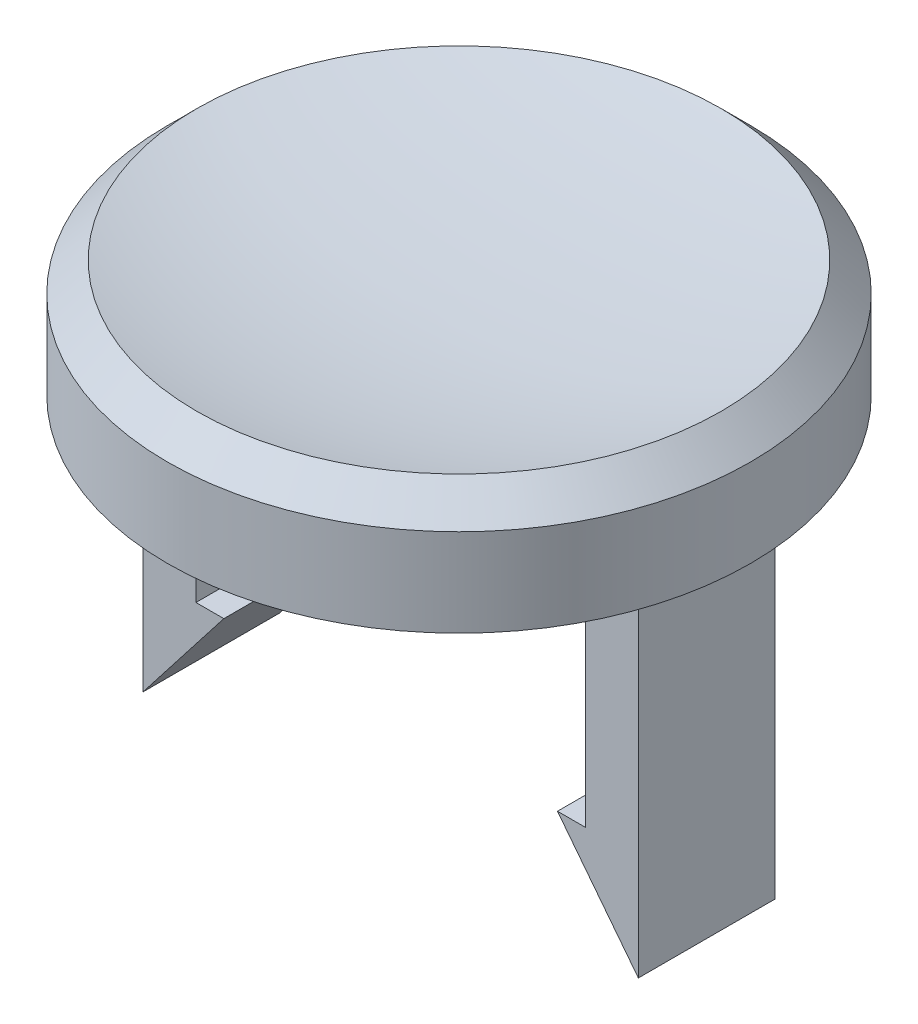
ISO-10303-21;
HEADER;
FILE_DESCRIPTION(('STEP AP214'),'2;1');
FILE_NAME('part.step','',(''),(''),'','','');
FILE_SCHEMA(('AUTOMOTIVE_DESIGN { 1 0 10303 214 1 1 1 1 }'));
ENDSEC;
DATA;
#1=APPLICATION_CONTEXT('core data for automotive mechanical design processes');
#2=APPLICATION_PROTOCOL_DEFINITION('international standard','automotive_design',2000,#1);
#3=PRODUCT_CONTEXT('',#1,'mechanical');
#4=PRODUCT('Part','Part','',(#3));
#5=PRODUCT_RELATED_PRODUCT_CATEGORY('part','',(#4));
#6=PRODUCT_DEFINITION_FORMATION('','',#4);
#7=PRODUCT_DEFINITION_CONTEXT('part definition',#1,'design');
#8=PRODUCT_DEFINITION('design','',#6,#7);
#9=PRODUCT_DEFINITION_SHAPE('','',#8);
#10=(LENGTH_UNIT() NAMED_UNIT(*) SI_UNIT(.MILLI.,.METRE.));
#11=(NAMED_UNIT(*) PLANE_ANGLE_UNIT() SI_UNIT($,.RADIAN.));
#12=(NAMED_UNIT(*) SI_UNIT($,.STERADIAN.) SOLID_ANGLE_UNIT());
#13=UNCERTAINTY_MEASURE_WITH_UNIT(LENGTH_MEASURE(1.E-05),#10,'distance_accuracy_value','');
#14=(GEOMETRIC_REPRESENTATION_CONTEXT(3) GLOBAL_UNCERTAINTY_ASSIGNED_CONTEXT((#13)) GLOBAL_UNIT_ASSIGNED_CONTEXT((#10,
#11,#12)) REPRESENTATION_CONTEXT('',''));
#15=CARTESIAN_POINT('',(0.,0.,0.));
#16=DIRECTION('',(0.,0.,1.));
#17=DIRECTION('',(1.,0.,0.));
#18=AXIS2_PLACEMENT_3D('',#15,#16,#17);
#19=CARTESIAN_POINT('',(0.,0.,0.));
#20=DIRECTION('',(0.,1.,0.));
#21=DIRECTION('',(0.,0.,1.));
#22=AXIS2_PLACEMENT_3D('',#19,#20,#21);
#23=PLANE('',#22);
#24=DIRECTION('',(-1.,0.,0.));
#25=VECTOR('',#24,1.);
#26=CARTESIAN_POINT('',(8.88,0.,-2.45));
#27=LINE('',#26,#25);
#28=CARTESIAN_POINT('',(8.88,0.,-2.45));
#29=VERTEX_POINT('',#28);
#30=CARTESIAN_POINT('',(6.98,0.,-2.45));
#31=VERTEX_POINT('',#30);
#32=EDGE_CURVE('E159',#29,#31,#27,.T.);
#33=ORIENTED_EDGE('',*,*,#32,.T.);
#34=DIRECTION('',(0.,0.,1.));
#35=VECTOR('',#34,1.);
#36=CARTESIAN_POINT('',(6.98,0.,-2.45));
#37=LINE('',#36,#35);
#38=CARTESIAN_POINT('',(6.98,0.,2.45));
#39=VERTEX_POINT('',#38);
#40=EDGE_CURVE('E155',#31,#39,#37,.T.);
#41=ORIENTED_EDGE('',*,*,#40,.T.);
#42=DIRECTION('',(1.,0.,0.));
#43=VECTOR('',#42,1.);
#44=CARTESIAN_POINT('',(8.88,0.,2.45));
#45=LINE('',#44,#43);
#46=CARTESIAN_POINT('',(8.88,0.,2.45));
#47=VERTEX_POINT('',#46);
#48=EDGE_CURVE('E167',#39,#47,#45,.T.);
#49=ORIENTED_EDGE('',*,*,#48,.T.);
#50=DIRECTION('',(0.,0.,-1.));
#51=VECTOR('',#50,1.);
#52=CARTESIAN_POINT('',(8.88,0.,-2.45));
#53=LINE('',#52,#51);
#54=EDGE_CURVE('E54',#47,#29,#53,.T.);
#55=ORIENTED_EDGE('',*,*,#54,.T.);
#56=EDGE_LOOP('',(#33,#41,#49,#55));
#57=FACE_BOUND('',#56,.T.);
#58=CARTESIAN_POINT('',(0.,0.,0.));
#59=DIRECTION('',(0.,1.,0.));
#60=DIRECTION('',(0.,0.,1.));
#61=AXIS2_PLACEMENT_3D('',#58,#59,#60);
#62=CIRCLE('',#61,10.45);
#63=CARTESIAN_POINT('',(0.,0.,10.45));
#64=VERTEX_POINT('',#63);
#65=EDGE_CURVE('E46',#64,#64,#62,.T.);
#66=ORIENTED_EDGE('',*,*,#65,.F.);
#67=EDGE_LOOP('',(#66));
#68=FACE_BOUND('',#67,.T.);
#69=DIRECTION('',(0.,0.,1.));
#70=VECTOR('',#69,1.);
#71=CARTESIAN_POINT('',(-6.98,0.,-2.45));
#72=LINE('',#71,#70);
#73=CARTESIAN_POINT('',(-6.98,0.,-2.45));
#74=VERTEX_POINT('',#73);
#75=CARTESIAN_POINT('',(-6.98,0.,2.45));
#76=VERTEX_POINT('',#75);
#77=EDGE_CURVE('E264',#74,#76,#72,.T.);
#78=ORIENTED_EDGE('',*,*,#77,.F.);
#79=DIRECTION('',(1.,0.,0.));
#80=VECTOR('',#79,1.);
#81=CARTESIAN_POINT('',(-8.88,0.,-2.45));
#82=LINE('',#81,#80);
#83=CARTESIAN_POINT('',(-8.88,0.,-2.45));
#84=VERTEX_POINT('',#83);
#85=EDGE_CURVE('E224',#84,#74,#82,.T.);
#86=ORIENTED_EDGE('',*,*,#85,.F.);
#87=DIRECTION('',(0.,0.,-1.));
#88=VECTOR('',#87,1.);
#89=CARTESIAN_POINT('',(-8.88,0.,-2.45));
#90=LINE('',#89,#88);
#91=CARTESIAN_POINT('',(-8.88,0.,2.45));
#92=VERTEX_POINT('',#91);
#93=EDGE_CURVE('E268',#92,#84,#90,.T.);
#94=ORIENTED_EDGE('',*,*,#93,.F.);
#95=DIRECTION('',(-1.,0.,0.));
#96=VECTOR('',#95,1.);
#97=CARTESIAN_POINT('',(-8.88,0.,2.45));
#98=LINE('',#97,#96);
#99=EDGE_CURVE('E62',#76,#92,#98,.T.);
#100=ORIENTED_EDGE('',*,*,#99,.F.);
#101=EDGE_LOOP('',(#78,#86,#94,#100));
#102=FACE_BOUND('',#101,.T.);
#103=ADVANCED_FACE('F37',(#57,#68,#102),#23,.F.);
#104=CARTESIAN_POINT('',(0.,4.2,0.));
#105=DIRECTION('',(0.,-1.,0.));
#106=DIRECTION('',(0.,0.,-1.));
#107=AXIS2_PLACEMENT_3D('',#104,#105,#106);
#108=CYLINDRICAL_SURFACE('',#107,10.45);
#109=CARTESIAN_POINT('',(0.,3.15,0.));
#110=DIRECTION('',(0.,1.,0.));
#111=DIRECTION('',(0.,0.,1.));
#112=AXIS2_PLACEMENT_3D('',#109,#110,#111);
#113=CIRCLE('',#112,10.45);
#114=CARTESIAN_POINT('',(0.,3.15,10.45));
#115=VERTEX_POINT('',#114);
#116=EDGE_CURVE('E11',#115,#115,#113,.F.);
#117=ORIENTED_EDGE('',*,*,#116,.T.);
#118=EDGE_LOOP('',(#117));
#119=FACE_BOUND('',#118,.T.);
#120=ORIENTED_EDGE('',*,*,#65,.T.);
#121=EDGE_LOOP('',(#120));
#122=FACE_BOUND('',#121,.T.);
#123=ADVANCED_FACE('F252',(#119,#122),#108,.T.);
#124=CARTESIAN_POINT('',(0.,4.2,0.));
#125=DIRECTION('',(0.,-1.,0.));
#126=DIRECTION('',(0.,0.,-1.));
#127=AXIS2_PLACEMENT_3D('',#124,#125,#126);
#128=CONICAL_SURFACE('',#127,9.4,0.785398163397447);
#129=ORIENTED_EDGE('',*,*,#116,.F.);
#130=EDGE_LOOP('',(#129));
#131=FACE_BOUND('',#130,.T.);
#132=CARTESIAN_POINT('',(0.,4.2,0.));
#133=DIRECTION('',(0.,-1.,0.));
#134=DIRECTION('',(0.,0.,-1.));
#135=AXIS2_PLACEMENT_3D('',#132,#133,#134);
#136=CIRCLE('',#135,9.4);
#137=CARTESIAN_POINT('',(0.,4.2,-9.4));
#138=VERTEX_POINT('',#137);
#139=EDGE_CURVE('E228',#138,#138,#136,.T.);
#140=ORIENTED_EDGE('',*,*,#139,.T.);
#141=EDGE_LOOP('',(#140));
#142=FACE_BOUND('',#141,.T.);
#143=ADVANCED_FACE('F39',(#131,#142),#128,.T.);
#144=CARTESIAN_POINT('',(0.,4.2,9.4));
#145=CARTESIAN_POINT('',(0.,3.17283314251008,5.48375547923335));
#146=CARTESIAN_POINT('',(0.,3.15,0.));
#147=B_SPLINE_CURVE_WITH_KNOTS('',2,(#144,#145,#146),.UNSPECIFIED.,.F.,.F.,(3,3),(0.,1.),.UNSPECIFIED.);
#148=CARTESIAN_POINT('',(0.,3.15,0.));
#149=DIRECTION('',(0.,-1.,0.));
#150=AXIS1_PLACEMENT('',#148,#149);
#151=SURFACE_OF_REVOLUTION('',#147,#150);
#152=CARTESIAN_POINT('',(0.,3.15,0.));
#153=VERTEX_POINT('',#152);
#154=VERTEX_LOOP('',#153);
#155=FACE_BOUND('',#154,.T.);
#156=ORIENTED_EDGE('',*,*,#139,.F.);
#157=EDGE_LOOP('',(#156));
#158=FACE_BOUND('',#157,.T.);
#159=ADVANCED_FACE('F244',(#155,#158),#151,.F.);
#160=CARTESIAN_POINT('',(-6.98,-8.7,-2.45));
#161=DIRECTION('',(-1.,0.,0.));
#162=DIRECTION('',(0.,0.,1.));
#163=AXIS2_PLACEMENT_3D('',#160,#161,#162);
#164=PLANE('',#163);
#165=ORIENTED_EDGE('',*,*,#77,.T.);
#166=DIRECTION('',(0.,1.,0.));
#167=VECTOR('',#166,1.);
#168=CARTESIAN_POINT('',(-6.98,-8.7,2.45));
#169=LINE('',#168,#167);
#170=CARTESIAN_POINT('',(-6.98,-8.7,2.45));
#171=VERTEX_POINT('',#170);
#172=EDGE_CURVE('E227',#171,#76,#169,.T.);
#173=ORIENTED_EDGE('',*,*,#172,.F.);
#174=DIRECTION('',(0.,0.,1.));
#175=VECTOR('',#174,1.);
#176=CARTESIAN_POINT('',(-6.98,-8.7,-2.45));
#177=LINE('',#176,#175);
#178=CARTESIAN_POINT('',(-6.98,-8.7,-2.45));
#179=VERTEX_POINT('',#178);
#180=EDGE_CURVE('E221',#179,#171,#177,.T.);
#181=ORIENTED_EDGE('',*,*,#180,.F.);
#182=DIRECTION('',(0.,1.,0.));
#183=VECTOR('',#182,1.);
#184=CARTESIAN_POINT('',(-6.98,-8.7,-2.45));
#185=LINE('',#184,#183);
#186=EDGE_CURVE('E218',#179,#74,#185,.T.);
#187=ORIENTED_EDGE('',*,*,#186,.T.);
#188=EDGE_LOOP('',(#165,#173,#181,#187));
#189=FACE_BOUND('',#188,.T.);
#190=ADVANCED_FACE('F248',(#189),#164,.F.);
#191=CARTESIAN_POINT('',(-8.88,-8.7,2.45));
#192=DIRECTION('',(0.,0.,-1.));
#193=DIRECTION('',(-1.,0.,0.));
#194=AXIS2_PLACEMENT_3D('',#191,#192,#193);
#195=PLANE('',#194);
#196=ORIENTED_EDGE('',*,*,#99,.T.);
#197=DIRECTION('',(0.,1.,0.));
#198=VECTOR('',#197,1.);
#199=CARTESIAN_POINT('',(-8.88,-8.7,2.45));
#200=LINE('',#199,#198);
#201=CARTESIAN_POINT('',(-8.88,-12.4276104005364,2.45));
#202=VERTEX_POINT('',#201);
#203=EDGE_CURVE('E229',#202,#92,#200,.T.);
#204=ORIENTED_EDGE('',*,*,#203,.F.);
#205=DIRECTION('',(0.614039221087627,0.789275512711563,0.));
#206=VECTOR('',#205,1.);
#207=CARTESIAN_POINT('',(0.491145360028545,-0.382100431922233,2.45));
#208=LINE('',#207,#206);
#209=CARTESIAN_POINT('',(-5.98,-8.7,2.45));
#210=VERTEX_POINT('',#209);
#211=EDGE_CURVE('E176',#202,#210,#208,.T.);
#212=ORIENTED_EDGE('',*,*,#211,.T.);
#213=DIRECTION('',(1.,0.,0.));
#214=VECTOR('',#213,1.);
#215=CARTESIAN_POINT('',(0.,-8.7,2.45));
#216=LINE('',#215,#214);
#217=EDGE_CURVE('E179',#171,#210,#216,.T.);
#218=ORIENTED_EDGE('',*,*,#217,.F.);
#219=ORIENTED_EDGE('',*,*,#172,.T.);
#220=EDGE_LOOP('',(#196,#204,#212,#218,#219));
#221=FACE_BOUND('',#220,.T.);
#222=ADVANCED_FACE('F286',(#221),#195,.F.);
#223=CARTESIAN_POINT('',(-8.88,-8.7,-2.45));
#224=DIRECTION('',(1.,0.,0.));
#225=DIRECTION('',(0.,0.,-1.));
#226=AXIS2_PLACEMENT_3D('',#223,#224,#225);
#227=PLANE('',#226);
#228=ORIENTED_EDGE('',*,*,#93,.T.);
#229=DIRECTION('',(0.,1.,0.));
#230=VECTOR('',#229,1.);
#231=CARTESIAN_POINT('',(-8.88,-8.7,-2.45));
#232=LINE('',#231,#230);
#233=CARTESIAN_POINT('',(-8.88,-12.4276104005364,-2.45));
#234=VERTEX_POINT('',#233);
#235=EDGE_CURVE('E210',#234,#84,#232,.T.);
#236=ORIENTED_EDGE('',*,*,#235,.F.);
#237=DIRECTION('',(0.,0.,-1.));
#238=VECTOR('',#237,1.);
#239=CARTESIAN_POINT('',(-8.88,-12.4276104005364,7.17282535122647));
#240=LINE('',#239,#238);
#241=EDGE_CURVE('E183',#202,#234,#240,.T.);
#242=ORIENTED_EDGE('',*,*,#241,.F.);
#243=ORIENTED_EDGE('',*,*,#203,.T.);
#244=EDGE_LOOP('',(#228,#236,#242,#243));
#245=FACE_BOUND('',#244,.T.);
#246=ADVANCED_FACE('F280',(#245),#227,.F.);
#247=CARTESIAN_POINT('',(-8.88,-8.7,-2.45));
#248=DIRECTION('',(0.,0.,1.));
#249=DIRECTION('',(1.,0.,0.));
#250=AXIS2_PLACEMENT_3D('',#247,#248,#249);
#251=PLANE('',#250);
#252=ORIENTED_EDGE('',*,*,#85,.T.);
#253=ORIENTED_EDGE('',*,*,#186,.F.);
#254=DIRECTION('',(-1.,0.,0.));
#255=VECTOR('',#254,1.);
#256=CARTESIAN_POINT('',(0.,-8.7,-2.45));
#257=LINE('',#256,#255);
#258=CARTESIAN_POINT('',(-5.98,-8.7,-2.45));
#259=VERTEX_POINT('',#258);
#260=EDGE_CURVE('E185',#259,#179,#257,.T.);
#261=ORIENTED_EDGE('',*,*,#260,.F.);
#262=DIRECTION('',(-0.614039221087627,-0.789275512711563,0.));
#263=VECTOR('',#262,1.);
#264=CARTESIAN_POINT('',(0.491145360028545,-0.382100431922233,-2.45));
#265=LINE('',#264,#263);
#266=EDGE_CURVE('E189',#259,#234,#265,.T.);
#267=ORIENTED_EDGE('',*,*,#266,.T.);
#268=ORIENTED_EDGE('',*,*,#235,.T.);
#269=EDGE_LOOP('',(#252,#253,#261,#267,#268));
#270=FACE_BOUND('',#269,.T.);
#271=ADVANCED_FACE('F209',(#270),#251,.F.);
#272=CARTESIAN_POINT('',(0.,-8.7,7.17282535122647));
#273=DIRECTION('',(0.,-1.,0.));
#274=DIRECTION('',(0.,0.,-1.));
#275=AXIS2_PLACEMENT_3D('',#272,#273,#274);
#276=PLANE('',#275);
#277=ORIENTED_EDGE('',*,*,#260,.T.);
#278=ORIENTED_EDGE('',*,*,#180,.T.);
#279=ORIENTED_EDGE('',*,*,#217,.T.);
#280=DIRECTION('',(0.,0.,-1.));
#281=VECTOR('',#280,1.);
#282=CARTESIAN_POINT('',(-5.98,-8.7,7.17282535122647));
#283=LINE('',#282,#281);
#284=EDGE_CURVE('E182',#210,#259,#283,.T.);
#285=ORIENTED_EDGE('',*,*,#284,.T.);
#286=EDGE_LOOP('',(#277,#278,#279,#285));
#287=FACE_BOUND('',#286,.T.);
#288=ADVANCED_FACE('F271',(#287),#276,.F.);
#289=CARTESIAN_POINT('',(0.491145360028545,-0.382100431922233,7.17282535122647));
#290=DIRECTION('',(0.789275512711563,-0.614039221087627,0.));
#291=DIRECTION('',(0.614039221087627,0.789275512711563,0.));
#292=AXIS2_PLACEMENT_3D('',#289,#290,#291);
#293=PLANE('',#292);
#294=ORIENTED_EDGE('',*,*,#211,.F.);
#295=ORIENTED_EDGE('',*,*,#241,.T.);
#296=ORIENTED_EDGE('',*,*,#266,.F.);
#297=ORIENTED_EDGE('',*,*,#284,.F.);
#298=EDGE_LOOP('',(#294,#295,#296,#297));
#299=FACE_BOUND('',#298,.T.);
#300=ADVANCED_FACE('F202',(#299),#293,.T.);
#301=CARTESIAN_POINT('',(6.98,-8.7,-2.45));
#302=DIRECTION('',(-1.,0.,0.));
#303=DIRECTION('',(0.,0.,1.));
#304=AXIS2_PLACEMENT_3D('',#301,#302,#303);
#305=PLANE('',#304);
#306=ORIENTED_EDGE('',*,*,#40,.F.);
#307=DIRECTION('',(0.,1.,0.));
#308=VECTOR('',#307,1.);
#309=CARTESIAN_POINT('',(6.98,-8.7,-2.45));
#310=LINE('',#309,#308);
#311=CARTESIAN_POINT('',(6.98,-8.7,-2.45));
#312=VERTEX_POINT('',#311);
#313=EDGE_CURVE('E173',#312,#31,#310,.T.);
#314=ORIENTED_EDGE('',*,*,#313,.F.);
#315=DIRECTION('',(0.,0.,1.));
#316=VECTOR('',#315,1.);
#317=CARTESIAN_POINT('',(6.98,-8.7,-2.45));
#318=LINE('',#317,#316);
#319=CARTESIAN_POINT('',(6.98,-8.7,2.45));
#320=VERTEX_POINT('',#319);
#321=EDGE_CURVE('E142',#312,#320,#318,.T.);
#322=ORIENTED_EDGE('',*,*,#321,.T.);
#323=DIRECTION('',(0.,1.,0.));
#324=VECTOR('',#323,1.);
#325=CARTESIAN_POINT('',(6.98,-8.7,2.45));
#326=LINE('',#325,#324);
#327=EDGE_CURVE('E171',#320,#39,#326,.T.);
#328=ORIENTED_EDGE('',*,*,#327,.T.);
#329=EDGE_LOOP('',(#306,#314,#322,#328));
#330=FACE_BOUND('',#329,.T.);
#331=ADVANCED_FACE('F278',(#330),#305,.T.);
#332=CARTESIAN_POINT('',(8.88,-8.7,-2.45));
#333=DIRECTION('',(0.,0.,-1.));
#334=DIRECTION('',(-1.,0.,0.));
#335=AXIS2_PLACEMENT_3D('',#332,#333,#334);
#336=PLANE('',#335);
#337=ORIENTED_EDGE('',*,*,#32,.F.);
#338=DIRECTION('',(0.,1.,0.));
#339=VECTOR('',#338,1.);
#340=CARTESIAN_POINT('',(8.88,-8.7,-2.45));
#341=LINE('',#340,#339);
#342=CARTESIAN_POINT('',(8.88,-12.4276104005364,-2.45));
#343=VERTEX_POINT('',#342);
#344=EDGE_CURVE('E137',#343,#29,#341,.T.);
#345=ORIENTED_EDGE('',*,*,#344,.F.);
#346=DIRECTION('',(0.614039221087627,-0.789275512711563,0.));
#347=VECTOR('',#346,1.);
#348=CARTESIAN_POINT('',(-0.491145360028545,-0.382100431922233,-2.45));
#349=LINE('',#348,#347);
#350=CARTESIAN_POINT('',(5.98,-8.7,-2.45));
#351=VERTEX_POINT('',#350);
#352=EDGE_CURVE('E124',#351,#343,#349,.T.);
#353=ORIENTED_EDGE('',*,*,#352,.F.);
#354=DIRECTION('',(1.,0.,0.));
#355=VECTOR('',#354,1.);
#356=CARTESIAN_POINT('',(0.,-8.7,-2.45));
#357=LINE('',#356,#355);
#358=EDGE_CURVE('E130',#351,#312,#357,.T.);
#359=ORIENTED_EDGE('',*,*,#358,.T.);
#360=ORIENTED_EDGE('',*,*,#313,.T.);
#361=EDGE_LOOP('',(#337,#345,#353,#359,#360));
#362=FACE_BOUND('',#361,.T.);
#363=ADVANCED_FACE('F135',(#362),#336,.T.);
#364=CARTESIAN_POINT('',(8.88,-8.7,-2.45));
#365=DIRECTION('',(1.,0.,0.));
#366=DIRECTION('',(0.,0.,-1.));
#367=AXIS2_PLACEMENT_3D('',#364,#365,#366);
#368=PLANE('',#367);
#369=ORIENTED_EDGE('',*,*,#54,.F.);
#370=DIRECTION('',(0.,1.,0.));
#371=VECTOR('',#370,1.);
#372=CARTESIAN_POINT('',(8.88,-8.7,2.45));
#373=LINE('',#372,#371);
#374=CARTESIAN_POINT('',(8.88,-12.4276104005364,2.45));
#375=VERTEX_POINT('',#374);
#376=EDGE_CURVE('E169',#375,#47,#373,.T.);
#377=ORIENTED_EDGE('',*,*,#376,.F.);
#378=DIRECTION('',(0.,0.,-1.));
#379=VECTOR('',#378,1.);
#380=CARTESIAN_POINT('',(8.88,-12.4276104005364,7.17282535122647));
#381=LINE('',#380,#379);
#382=EDGE_CURVE('E129',#375,#343,#381,.T.);
#383=ORIENTED_EDGE('',*,*,#382,.T.);
#384=ORIENTED_EDGE('',*,*,#344,.T.);
#385=EDGE_LOOP('',(#369,#377,#383,#384));
#386=FACE_BOUND('',#385,.T.);
#387=ADVANCED_FACE('F372',(#386),#368,.T.);
#388=CARTESIAN_POINT('',(8.88,-8.7,2.45));
#389=DIRECTION('',(0.,0.,1.));
#390=DIRECTION('',(1.,0.,0.));
#391=AXIS2_PLACEMENT_3D('',#388,#389,#390);
#392=PLANE('',#391);
#393=ORIENTED_EDGE('',*,*,#48,.F.);
#394=ORIENTED_EDGE('',*,*,#327,.F.);
#395=DIRECTION('',(-1.,0.,0.));
#396=VECTOR('',#395,1.);
#397=CARTESIAN_POINT('',(0.,-8.7,2.45));
#398=LINE('',#397,#396);
#399=CARTESIAN_POINT('',(5.98,-8.7,2.45));
#400=VERTEX_POINT('',#399);
#401=EDGE_CURVE('E147',#320,#400,#398,.T.);
#402=ORIENTED_EDGE('',*,*,#401,.T.);
#403=DIRECTION('',(-0.614039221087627,0.789275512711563,0.));
#404=VECTOR('',#403,1.);
#405=CARTESIAN_POINT('',(-0.491145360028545,-0.382100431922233,2.45));
#406=LINE('',#405,#404);
#407=EDGE_CURVE('E126',#375,#400,#406,.T.);
#408=ORIENTED_EDGE('',*,*,#407,.F.);
#409=ORIENTED_EDGE('',*,*,#376,.T.);
#410=EDGE_LOOP('',(#393,#394,#402,#408,#409));
#411=FACE_BOUND('',#410,.T.);
#412=ADVANCED_FACE('F380',(#411),#392,.T.);
#413=CARTESIAN_POINT('',(0.,-8.7,7.17282535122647));
#414=DIRECTION('',(0.,1.,0.));
#415=DIRECTION('',(0.,0.,1.));
#416=AXIS2_PLACEMENT_3D('',#413,#414,#415);
#417=PLANE('',#416);
#418=ORIENTED_EDGE('',*,*,#321,.F.);
#419=ORIENTED_EDGE('',*,*,#358,.F.);
#420=DIRECTION('',(0.,0.,-1.));
#421=VECTOR('',#420,1.);
#422=CARTESIAN_POINT('',(5.98,-8.7,7.17282535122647));
#423=LINE('',#422,#421);
#424=EDGE_CURVE('E120',#400,#351,#423,.T.);
#425=ORIENTED_EDGE('',*,*,#424,.F.);
#426=ORIENTED_EDGE('',*,*,#401,.F.);
#427=EDGE_LOOP('',(#418,#419,#425,#426));
#428=FACE_BOUND('',#427,.T.);
#429=ADVANCED_FACE('F140',(#428),#417,.T.);
#430=CARTESIAN_POINT('',(-0.491145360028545,-0.382100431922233,7.17282535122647));
#431=DIRECTION('',(0.789275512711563,0.614039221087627,0.));
#432=DIRECTION('',(-0.614039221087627,0.789275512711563,0.));
#433=AXIS2_PLACEMENT_3D('',#430,#431,#432);
#434=PLANE('',#433);
#435=ORIENTED_EDGE('',*,*,#382,.F.);
#436=ORIENTED_EDGE('',*,*,#407,.T.);
#437=ORIENTED_EDGE('',*,*,#424,.T.);
#438=ORIENTED_EDGE('',*,*,#352,.T.);
#439=EDGE_LOOP('',(#435,#436,#437,#438));
#440=FACE_BOUND('',#439,.T.);
#441=ADVANCED_FACE('F123',(#440),#434,.F.);
#442=CLOSED_SHELL('',(#103,#123,#143,#159,#190,#222,#246,#271,#288,#300,#331,#363,#387,#412,
#429,#441));
#443=MANIFOLD_SOLID_BREP('B2',#442);
#444=ADVANCED_BREP_SHAPE_REPRESENTATION('',(#18,#443),#14);
#445=SHAPE_DEFINITION_REPRESENTATION(#9,#444);
ENDSEC;
END-ISO-10303-21;
